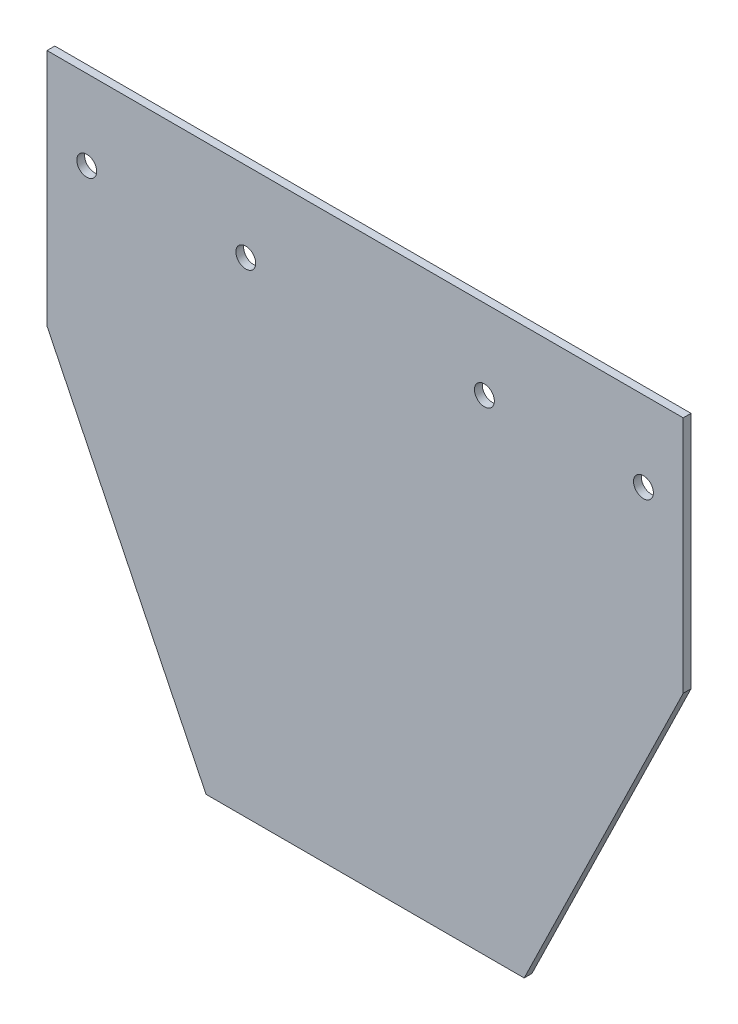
ISO-10303-21;
HEADER;
FILE_DESCRIPTION(('STEP AP214'),'2;1');
FILE_NAME('part.step','',(''),(''),'','','');
FILE_SCHEMA(('AUTOMOTIVE_DESIGN { 1 0 10303 214 1 1 1 1 }'));
ENDSEC;
DATA;
#1=APPLICATION_CONTEXT('core data for automotive mechanical design processes');
#2=APPLICATION_PROTOCOL_DEFINITION('international standard','automotive_design',2000,#1);
#3=PRODUCT_CONTEXT('',#1,'mechanical');
#4=PRODUCT('Part','Part','',(#3));
#5=PRODUCT_RELATED_PRODUCT_CATEGORY('part','',(#4));
#6=PRODUCT_DEFINITION_FORMATION('','',#4);
#7=PRODUCT_DEFINITION_CONTEXT('part definition',#1,'design');
#8=PRODUCT_DEFINITION('design','',#6,#7);
#9=PRODUCT_DEFINITION_SHAPE('','',#8);
#10=(LENGTH_UNIT() NAMED_UNIT(*) SI_UNIT(.MILLI.,.METRE.));
#11=(NAMED_UNIT(*) PLANE_ANGLE_UNIT() SI_UNIT($,.RADIAN.));
#12=(NAMED_UNIT(*) SI_UNIT($,.STERADIAN.) SOLID_ANGLE_UNIT());
#13=UNCERTAINTY_MEASURE_WITH_UNIT(LENGTH_MEASURE(1.E-05),#10,'distance_accuracy_value','');
#14=(GEOMETRIC_REPRESENTATION_CONTEXT(3) GLOBAL_UNCERTAINTY_ASSIGNED_CONTEXT((#13)) GLOBAL_UNIT_ASSIGNED_CONTEXT((#10,
#11,#12)) REPRESENTATION_CONTEXT('',''));
#15=CARTESIAN_POINT('',(0.,0.,0.));
#16=DIRECTION('',(0.,0.,1.));
#17=DIRECTION('',(1.,0.,0.));
#18=AXIS2_PLACEMENT_3D('',#15,#16,#17);
#19=CARTESIAN_POINT('',(25.4,-71.12,1.2446));
#20=DIRECTION('',(-0.8987684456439,0.438423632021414,0.));
#21=DIRECTION('',(-0.438423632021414,-0.8987684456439,0.));
#22=AXIS2_PLACEMENT_3D('',#19,#20,#21);
#23=PLANE('',#22);
#24=DIRECTION('',(0.438423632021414,0.8987684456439,0.));
#25=VECTOR('',#24,1.);
#26=CARTESIAN_POINT('',(25.4,-71.12,0.));
#27=LINE('',#26,#25);
#28=CARTESIAN_POINT('',(25.4,-71.12,0.));
#29=VERTEX_POINT('',#28);
#30=CARTESIAN_POINT('',(50.8,-19.05,0.));
#31=VERTEX_POINT('',#30);
#32=EDGE_CURVE('E140',#29,#31,#27,.T.);
#33=ORIENTED_EDGE('',*,*,#32,.T.);
#34=DIRECTION('',(0.,0.,-1.));
#35=VECTOR('',#34,1.);
#36=CARTESIAN_POINT('',(50.8,-19.05,1.2446));
#37=LINE('',#36,#35);
#38=CARTESIAN_POINT('',(50.8,-19.05,1.2446));
#39=VERTEX_POINT('',#38);
#40=EDGE_CURVE('E11',#39,#31,#37,.T.);
#41=ORIENTED_EDGE('',*,*,#40,.F.);
#42=DIRECTION('',(0.438423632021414,0.8987684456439,0.));
#43=VECTOR('',#42,1.);
#44=CARTESIAN_POINT('',(25.4,-71.12,1.2446));
#45=LINE('',#44,#43);
#46=CARTESIAN_POINT('',(25.4,-71.12,1.2446));
#47=VERTEX_POINT('',#46);
#48=EDGE_CURVE('E156',#47,#39,#45,.T.);
#49=ORIENTED_EDGE('',*,*,#48,.F.);
#50=DIRECTION('',(0.,0.,-1.));
#51=VECTOR('',#50,1.);
#52=CARTESIAN_POINT('',(25.4,-71.12,1.2446));
#53=LINE('',#52,#51);
#54=EDGE_CURVE('E136',#47,#29,#53,.T.);
#55=ORIENTED_EDGE('',*,*,#54,.T.);
#56=EDGE_LOOP('',(#33,#41,#49,#55));
#57=FACE_BOUND('',#56,.T.);
#58=ADVANCED_FACE('F47',(#57),#23,.F.);
#59=CARTESIAN_POINT('',(50.8,19.05,1.2446));
#60=DIRECTION('',(-1.,0.,0.));
#61=DIRECTION('',(0.,0.,1.));
#62=AXIS2_PLACEMENT_3D('',#59,#60,#61);
#63=PLANE('',#62);
#64=DIRECTION('',(0.,1.,0.));
#65=VECTOR('',#64,1.);
#66=CARTESIAN_POINT('',(50.8,19.05,0.));
#67=LINE('',#66,#65);
#68=CARTESIAN_POINT('',(50.8,19.05,0.));
#69=VERTEX_POINT('',#68);
#70=EDGE_CURVE('E144',#31,#69,#67,.T.);
#71=ORIENTED_EDGE('',*,*,#70,.T.);
#72=DIRECTION('',(0.,0.,-1.));
#73=VECTOR('',#72,1.);
#74=CARTESIAN_POINT('',(50.8,19.05,1.2446));
#75=LINE('',#74,#73);
#76=CARTESIAN_POINT('',(50.8,19.05,1.2446));
#77=VERTEX_POINT('',#76);
#78=EDGE_CURVE('E57',#77,#69,#75,.T.);
#79=ORIENTED_EDGE('',*,*,#78,.F.);
#80=DIRECTION('',(0.,1.,0.));
#81=VECTOR('',#80,1.);
#82=CARTESIAN_POINT('',(50.8,19.05,1.2446));
#83=LINE('',#82,#81);
#84=EDGE_CURVE('E103',#39,#77,#83,.T.);
#85=ORIENTED_EDGE('',*,*,#84,.F.);
#86=ORIENTED_EDGE('',*,*,#40,.T.);
#87=EDGE_LOOP('',(#71,#79,#85,#86));
#88=FACE_BOUND('',#87,.T.);
#89=ADVANCED_FACE('F216',(#88),#63,.F.);
#90=CARTESIAN_POINT('',(-50.8,19.05,1.2446));
#91=DIRECTION('',(0.,-1.,0.));
#92=DIRECTION('',(0.,0.,-1.));
#93=AXIS2_PLACEMENT_3D('',#90,#91,#92);
#94=PLANE('',#93);
#95=DIRECTION('',(-1.,0.,0.));
#96=VECTOR('',#95,1.);
#97=CARTESIAN_POINT('',(-50.8,19.05,0.));
#98=LINE('',#97,#96);
#99=CARTESIAN_POINT('',(-50.8,19.05,0.));
#100=VERTEX_POINT('',#99);
#101=EDGE_CURVE('E147',#69,#100,#98,.T.);
#102=ORIENTED_EDGE('',*,*,#101,.T.);
#103=DIRECTION('',(0.,0.,-1.));
#104=VECTOR('',#103,1.);
#105=CARTESIAN_POINT('',(-50.8,19.05,1.2446));
#106=LINE('',#105,#104);
#107=CARTESIAN_POINT('',(-50.8,19.05,1.2446));
#108=VERTEX_POINT('',#107);
#109=EDGE_CURVE('E127',#108,#100,#106,.T.);
#110=ORIENTED_EDGE('',*,*,#109,.F.);
#111=DIRECTION('',(-1.,0.,0.));
#112=VECTOR('',#111,1.);
#113=CARTESIAN_POINT('',(-50.8,19.05,1.2446));
#114=LINE('',#113,#112);
#115=EDGE_CURVE('E116',#77,#108,#114,.T.);
#116=ORIENTED_EDGE('',*,*,#115,.F.);
#117=ORIENTED_EDGE('',*,*,#78,.T.);
#118=EDGE_LOOP('',(#102,#110,#116,#117));
#119=FACE_BOUND('',#118,.T.);
#120=ADVANCED_FACE('F220',(#119),#94,.F.);
#121=CARTESIAN_POINT('',(-50.8,19.05,1.2446));
#122=DIRECTION('',(1.,0.,0.));
#123=DIRECTION('',(0.,1.,0.));
#124=AXIS2_PLACEMENT_3D('',#121,#122,#123);
#125=PLANE('',#124);
#126=DIRECTION('',(0.,-1.,0.));
#127=VECTOR('',#126,1.);
#128=CARTESIAN_POINT('',(-50.8,19.05,0.));
#129=LINE('',#128,#127);
#130=CARTESIAN_POINT('',(-50.8,-19.05,0.));
#131=VERTEX_POINT('',#130);
#132=EDGE_CURVE('E125',#100,#131,#129,.T.);
#133=ORIENTED_EDGE('',*,*,#132,.T.);
#134=DIRECTION('',(0.,0.,-1.));
#135=VECTOR('',#134,1.);
#136=CARTESIAN_POINT('',(-50.8,-19.05,1.2446));
#137=LINE('',#136,#135);
#138=CARTESIAN_POINT('',(-50.8,-19.05,1.2446));
#139=VERTEX_POINT('',#138);
#140=EDGE_CURVE('E122',#139,#131,#137,.T.);
#141=ORIENTED_EDGE('',*,*,#140,.F.);
#142=DIRECTION('',(0.,-1.,0.));
#143=VECTOR('',#142,1.);
#144=CARTESIAN_POINT('',(-50.8,19.05,1.2446));
#145=LINE('',#144,#143);
#146=EDGE_CURVE('E110',#108,#139,#145,.T.);
#147=ORIENTED_EDGE('',*,*,#146,.F.);
#148=ORIENTED_EDGE('',*,*,#109,.T.);
#149=EDGE_LOOP('',(#133,#141,#147,#148));
#150=FACE_BOUND('',#149,.T.);
#151=ADVANCED_FACE('F123',(#150),#125,.F.);
#152=CARTESIAN_POINT('',(-50.8,-19.05,1.2446));
#153=DIRECTION('',(0.8987684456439,0.438423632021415,0.));
#154=DIRECTION('',(-0.438423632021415,0.8987684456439,0.));
#155=AXIS2_PLACEMENT_3D('',#152,#153,#154);
#156=PLANE('',#155);
#157=DIRECTION('',(0.438423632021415,-0.8987684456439,0.));
#158=VECTOR('',#157,1.);
#159=CARTESIAN_POINT('',(-50.8,-19.05,0.));
#160=LINE('',#159,#158);
#161=CARTESIAN_POINT('',(-25.4,-71.12,0.));
#162=VERTEX_POINT('',#161);
#163=EDGE_CURVE('E89',#131,#162,#160,.T.);
#164=ORIENTED_EDGE('',*,*,#163,.T.);
#165=DIRECTION('',(0.,0.,-1.));
#166=VECTOR('',#165,1.);
#167=CARTESIAN_POINT('',(-25.4,-71.12,1.2446));
#168=LINE('',#167,#166);
#169=CARTESIAN_POINT('',(-25.4,-71.12,1.2446));
#170=VERTEX_POINT('',#169);
#171=EDGE_CURVE('E128',#170,#162,#168,.T.);
#172=ORIENTED_EDGE('',*,*,#171,.F.);
#173=DIRECTION('',(0.438423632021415,-0.8987684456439,0.));
#174=VECTOR('',#173,1.);
#175=CARTESIAN_POINT('',(-50.8,-19.05,1.2446));
#176=LINE('',#175,#174);
#177=EDGE_CURVE('E114',#139,#170,#176,.T.);
#178=ORIENTED_EDGE('',*,*,#177,.F.);
#179=ORIENTED_EDGE('',*,*,#140,.T.);
#180=EDGE_LOOP('',(#164,#172,#178,#179));
#181=FACE_BOUND('',#180,.T.);
#182=ADVANCED_FACE('F130',(#181),#156,.F.);
#183=CARTESIAN_POINT('',(-25.4,-71.12,1.2446));
#184=DIRECTION('',(0.,1.,0.));
#185=DIRECTION('',(-1.,0.,0.));
#186=AXIS2_PLACEMENT_3D('',#183,#184,#185);
#187=PLANE('',#186);
#188=DIRECTION('',(1.,0.,0.));
#189=VECTOR('',#188,1.);
#190=CARTESIAN_POINT('',(-25.4,-71.12,0.));
#191=LINE('',#190,#189);
#192=EDGE_CURVE('E95',#162,#29,#191,.T.);
#193=ORIENTED_EDGE('',*,*,#192,.T.);
#194=ORIENTED_EDGE('',*,*,#54,.F.);
#195=DIRECTION('',(1.,0.,0.));
#196=VECTOR('',#195,1.);
#197=CARTESIAN_POINT('',(-25.4,-71.12,1.2446));
#198=LINE('',#197,#196);
#199=EDGE_CURVE('E66',#170,#47,#198,.T.);
#200=ORIENTED_EDGE('',*,*,#199,.F.);
#201=ORIENTED_EDGE('',*,*,#171,.T.);
#202=EDGE_LOOP('',(#193,#194,#200,#201));
#203=FACE_BOUND('',#202,.T.);
#204=ADVANCED_FACE('F205',(#203),#187,.F.);
#205=CARTESIAN_POINT('',(0.,0.,1.2446));
#206=DIRECTION('',(0.,0.,-1.));
#207=DIRECTION('',(-1.,0.,0.));
#208=AXIS2_PLACEMENT_3D('',#205,#206,#207);
#209=PLANE('',#208);
#210=CARTESIAN_POINT('',(-44.45,6.2875,1.2446));
#211=DIRECTION('',(0.,0.,1.));
#212=DIRECTION('',(1.,0.,0.));
#213=AXIS2_PLACEMENT_3D('',#210,#211,#212);
#214=CIRCLE('',#213,1.5875);
#215=CARTESIAN_POINT('',(-42.8625,6.2875,1.2446));
#216=VERTEX_POINT('',#215);
#217=EDGE_CURVE('E171',#216,#216,#214,.T.);
#218=ORIENTED_EDGE('',*,*,#217,.F.);
#219=EDGE_LOOP('',(#218));
#220=FACE_BOUND('',#219,.T.);
#221=CARTESIAN_POINT('',(-19.05,6.2875,1.2446));
#222=DIRECTION('',(0.,0.,1.));
#223=DIRECTION('',(1.,0.,0.));
#224=AXIS2_PLACEMENT_3D('',#221,#222,#223);
#225=CIRCLE('',#224,1.5875);
#226=CARTESIAN_POINT('',(-17.4625,6.2875,1.2446));
#227=VERTEX_POINT('',#226);
#228=EDGE_CURVE('E296',#227,#227,#225,.T.);
#229=ORIENTED_EDGE('',*,*,#228,.F.);
#230=EDGE_LOOP('',(#229));
#231=FACE_BOUND('',#230,.T.);
#232=CARTESIAN_POINT('',(19.05,6.2875,1.2446));
#233=DIRECTION('',(0.,0.,1.));
#234=DIRECTION('',(1.,0.,0.));
#235=AXIS2_PLACEMENT_3D('',#232,#233,#234);
#236=CIRCLE('',#235,1.5875);
#237=CARTESIAN_POINT('',(20.6375,6.2875,1.2446));
#238=VERTEX_POINT('',#237);
#239=EDGE_CURVE('E299',#238,#238,#236,.T.);
#240=ORIENTED_EDGE('',*,*,#239,.F.);
#241=EDGE_LOOP('',(#240));
#242=FACE_BOUND('',#241,.T.);
#243=CARTESIAN_POINT('',(44.45,6.2875,1.2446));
#244=DIRECTION('',(0.,0.,1.));
#245=DIRECTION('',(1.,0.,0.));
#246=AXIS2_PLACEMENT_3D('',#243,#244,#245);
#247=CIRCLE('',#246,1.5875);
#248=CARTESIAN_POINT('',(46.0375,6.2875,1.2446));
#249=VERTEX_POINT('',#248);
#250=EDGE_CURVE('E308',#249,#249,#247,.T.);
#251=ORIENTED_EDGE('',*,*,#250,.F.);
#252=EDGE_LOOP('',(#251));
#253=FACE_BOUND('',#252,.T.);
#254=ORIENTED_EDGE('',*,*,#48,.T.);
#255=ORIENTED_EDGE('',*,*,#84,.T.);
#256=ORIENTED_EDGE('',*,*,#115,.T.);
#257=ORIENTED_EDGE('',*,*,#146,.T.);
#258=ORIENTED_EDGE('',*,*,#177,.T.);
#259=ORIENTED_EDGE('',*,*,#199,.T.);
#260=EDGE_LOOP('',(#254,#255,#256,#257,#258,#259));
#261=FACE_BOUND('',#260,.T.);
#262=ADVANCED_FACE('F112',(#220,#231,#242,#253,#261),#209,.F.);
#263=CARTESIAN_POINT('',(0.,0.,0.));
#264=DIRECTION('',(0.,0.,-1.));
#265=DIRECTION('',(-1.,0.,0.));
#266=AXIS2_PLACEMENT_3D('',#263,#264,#265);
#267=PLANE('',#266);
#268=CARTESIAN_POINT('',(-44.45,6.2875,0.));
#269=DIRECTION('',(0.,0.,-1.));
#270=DIRECTION('',(-1.,0.,0.));
#271=AXIS2_PLACEMENT_3D('',#268,#269,#270);
#272=CIRCLE('',#271,1.5875);
#273=CARTESIAN_POINT('',(-46.0375,6.2875,0.));
#274=VERTEX_POINT('',#273);
#275=EDGE_CURVE('E50',#274,#274,#272,.T.);
#276=ORIENTED_EDGE('',*,*,#275,.F.);
#277=EDGE_LOOP('',(#276));
#278=FACE_BOUND('',#277,.T.);
#279=CARTESIAN_POINT('',(-19.05,6.2875,0.));
#280=DIRECTION('',(0.,0.,-1.));
#281=DIRECTION('',(-1.,0.,0.));
#282=AXIS2_PLACEMENT_3D('',#279,#280,#281);
#283=CIRCLE('',#282,1.5875);
#284=CARTESIAN_POINT('',(-20.6375,6.2875,0.));
#285=VERTEX_POINT('',#284);
#286=EDGE_CURVE('E174',#285,#285,#283,.T.);
#287=ORIENTED_EDGE('',*,*,#286,.F.);
#288=EDGE_LOOP('',(#287));
#289=FACE_BOUND('',#288,.T.);
#290=CARTESIAN_POINT('',(19.05,6.2875,0.));
#291=DIRECTION('',(0.,0.,-1.));
#292=DIRECTION('',(-1.,0.,0.));
#293=AXIS2_PLACEMENT_3D('',#290,#291,#292);
#294=CIRCLE('',#293,1.5875);
#295=CARTESIAN_POINT('',(17.4625,6.2875,0.));
#296=VERTEX_POINT('',#295);
#297=EDGE_CURVE('E170',#296,#296,#294,.T.);
#298=ORIENTED_EDGE('',*,*,#297,.F.);
#299=EDGE_LOOP('',(#298));
#300=FACE_BOUND('',#299,.T.);
#301=CARTESIAN_POINT('',(44.45,6.2875,0.));
#302=DIRECTION('',(0.,0.,-1.));
#303=DIRECTION('',(-1.,0.,0.));
#304=AXIS2_PLACEMENT_3D('',#301,#302,#303);
#305=CIRCLE('',#304,1.5875);
#306=CARTESIAN_POINT('',(42.8625,6.2875,0.));
#307=VERTEX_POINT('',#306);
#308=EDGE_CURVE('E166',#307,#307,#305,.T.);
#309=ORIENTED_EDGE('',*,*,#308,.F.);
#310=EDGE_LOOP('',(#309));
#311=FACE_BOUND('',#310,.T.);
#312=ORIENTED_EDGE('',*,*,#32,.F.);
#313=ORIENTED_EDGE('',*,*,#192,.F.);
#314=ORIENTED_EDGE('',*,*,#163,.F.);
#315=ORIENTED_EDGE('',*,*,#132,.F.);
#316=ORIENTED_EDGE('',*,*,#101,.F.);
#317=ORIENTED_EDGE('',*,*,#70,.F.);
#318=EDGE_LOOP('',(#312,#313,#314,#315,#316,#317));
#319=FACE_BOUND('',#318,.T.);
#320=ADVANCED_FACE('F190',(#278,#289,#300,#311,#319),#267,.T.);
#321=CARTESIAN_POINT('',(44.45,6.2875,-14.986));
#322=DIRECTION('',(0.,0.,1.));
#323=DIRECTION('',(1.,0.,0.));
#324=AXIS2_PLACEMENT_3D('',#321,#322,#323);
#325=CYLINDRICAL_SURFACE('',#324,1.5875);
#326=ORIENTED_EDGE('',*,*,#308,.T.);
#327=EDGE_LOOP('',(#326));
#328=FACE_BOUND('',#327,.T.);
#329=ORIENTED_EDGE('',*,*,#250,.T.);
#330=EDGE_LOOP('',(#329));
#331=FACE_BOUND('',#330,.T.);
#332=ADVANCED_FACE('F193',(#328,#331),#325,.F.);
#333=CARTESIAN_POINT('',(19.05,6.2875,-14.986));
#334=DIRECTION('',(0.,0.,1.));
#335=DIRECTION('',(1.,0.,0.));
#336=AXIS2_PLACEMENT_3D('',#333,#334,#335);
#337=CYLINDRICAL_SURFACE('',#336,1.5875);
#338=ORIENTED_EDGE('',*,*,#297,.T.);
#339=EDGE_LOOP('',(#338));
#340=FACE_BOUND('',#339,.T.);
#341=ORIENTED_EDGE('',*,*,#239,.T.);
#342=EDGE_LOOP('',(#341));
#343=FACE_BOUND('',#342,.T.);
#344=ADVANCED_FACE('F263',(#340,#343),#337,.F.);
#345=CARTESIAN_POINT('',(-19.05,6.2875,-14.986));
#346=DIRECTION('',(0.,0.,1.));
#347=DIRECTION('',(1.,0.,0.));
#348=AXIS2_PLACEMENT_3D('',#345,#346,#347);
#349=CYLINDRICAL_SURFACE('',#348,1.5875);
#350=ORIENTED_EDGE('',*,*,#286,.T.);
#351=EDGE_LOOP('',(#350));
#352=FACE_BOUND('',#351,.T.);
#353=ORIENTED_EDGE('',*,*,#228,.T.);
#354=EDGE_LOOP('',(#353));
#355=FACE_BOUND('',#354,.T.);
#356=ADVANCED_FACE('F273',(#352,#355),#349,.F.);
#357=CARTESIAN_POINT('',(-44.45,6.2875,-14.986));
#358=DIRECTION('',(0.,0.,1.));
#359=DIRECTION('',(1.,0.,0.));
#360=AXIS2_PLACEMENT_3D('',#357,#358,#359);
#361=CYLINDRICAL_SURFACE('',#360,1.5875);
#362=ORIENTED_EDGE('',*,*,#275,.T.);
#363=EDGE_LOOP('',(#362));
#364=FACE_BOUND('',#363,.T.);
#365=ORIENTED_EDGE('',*,*,#217,.T.);
#366=EDGE_LOOP('',(#365));
#367=FACE_BOUND('',#366,.T.);
#368=ADVANCED_FACE('F187',(#364,#367),#361,.F.);
#369=CLOSED_SHELL('',(#58,#89,#120,#151,#182,#204,#262,#320,#332,#344,#356,#368));
#370=MANIFOLD_SOLID_BREP('B2',#369);
#371=ADVANCED_BREP_SHAPE_REPRESENTATION('',(#18,#370),#14);
#372=SHAPE_DEFINITION_REPRESENTATION(#9,#371);
ENDSEC;
END-ISO-10303-21;
